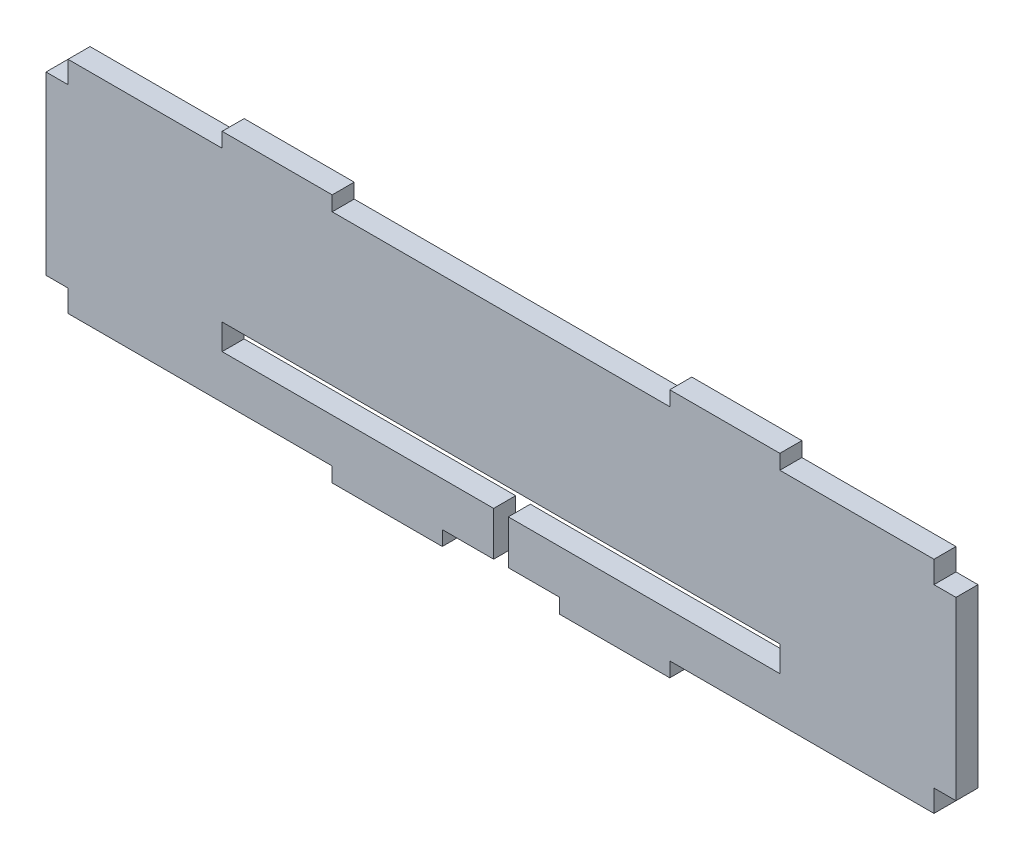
from build123d import *

# Parameters (mm, degrees)
BOSS_EXTRUDE3_DEPTH = 3


with BuildPart() as part:
    # Sketch1 → Boss-Extrude3 (new body)
    with BuildSketch(Plane.XY):
        Polygon((6, 3), (6, 0), (42, 0), (42, -2), (57, -2), (57, 0), (64, 0), (64, 6), (27, 6), (27, 9.5), (103, 9.5), (103, 6), (66, 6), (66, 0), (73, 0), (73, -2), (88, -2), (88, 0), (124, 0), (124, 3), (127, 3), (127, 27), (124, 27), (124, 30), (103, 30), (103, 32), (88, 32), (88, 30), (42, 30), (42, 32), (27, 32), (27, 30), (6, 30), (6, 27), (3, 27), (3, 3), align=None)
    extrude(amount=BOSS_EXTRUDE3_DEPTH)


solid = part.part
